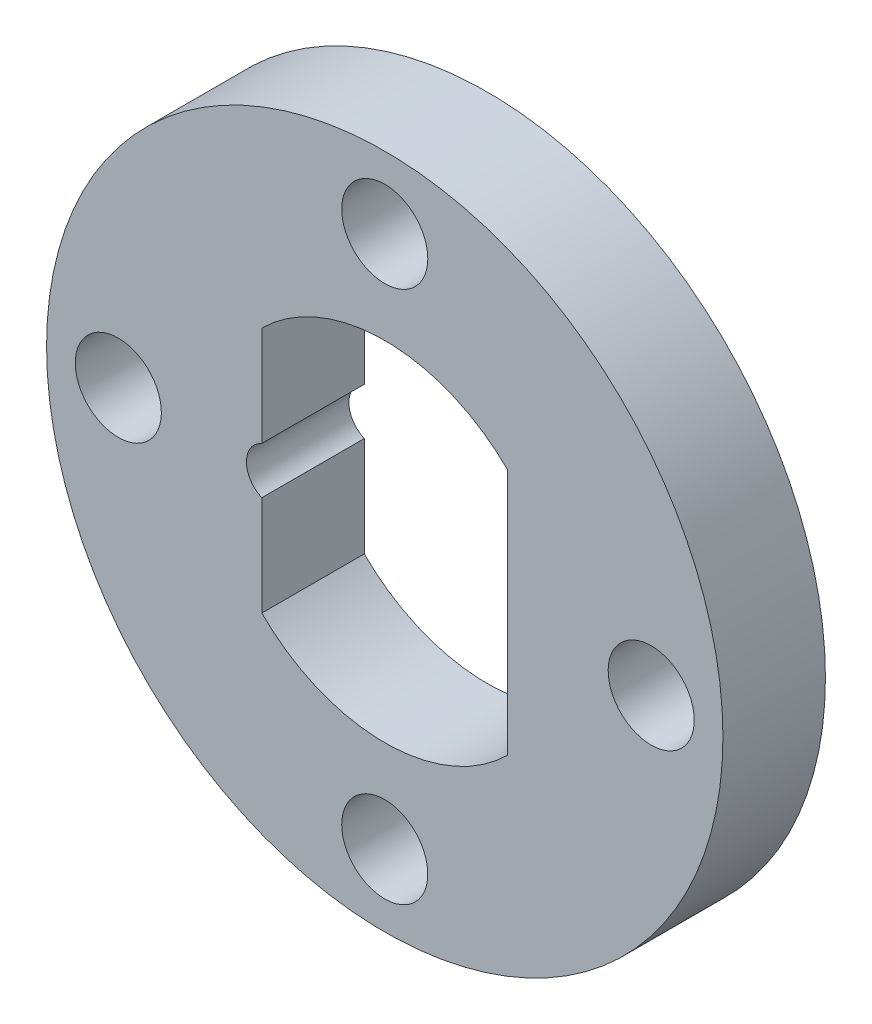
ISO-10303-21;
HEADER;
FILE_DESCRIPTION(('STEP AP214'),'2;1');
FILE_NAME('part.step','',(''),(''),'','','');
FILE_SCHEMA(('AUTOMOTIVE_DESIGN { 1 0 10303 214 1 1 1 1 }'));
ENDSEC;
DATA;
#1=APPLICATION_CONTEXT('core data for automotive mechanical design processes');
#2=APPLICATION_PROTOCOL_DEFINITION('international standard','automotive_design',2000,#1);
#3=PRODUCT_CONTEXT('',#1,'mechanical');
#4=PRODUCT('Part','Part','',(#3));
#5=PRODUCT_RELATED_PRODUCT_CATEGORY('part','',(#4));
#6=PRODUCT_DEFINITION_FORMATION('','',#4);
#7=PRODUCT_DEFINITION_CONTEXT('part definition',#1,'design');
#8=PRODUCT_DEFINITION('design','',#6,#7);
#9=PRODUCT_DEFINITION_SHAPE('','',#8);
#10=(LENGTH_UNIT() NAMED_UNIT(*) SI_UNIT(.MILLI.,.METRE.));
#11=(NAMED_UNIT(*) PLANE_ANGLE_UNIT() SI_UNIT($,.RADIAN.));
#12=(NAMED_UNIT(*) SI_UNIT($,.STERADIAN.) SOLID_ANGLE_UNIT());
#13=UNCERTAINTY_MEASURE_WITH_UNIT(LENGTH_MEASURE(1.E-05),#10,'distance_accuracy_value','');
#14=(GEOMETRIC_REPRESENTATION_CONTEXT(3) GLOBAL_UNCERTAINTY_ASSIGNED_CONTEXT((#13)) GLOBAL_UNIT_ASSIGNED_CONTEXT((#10,
#11,#12)) REPRESENTATION_CONTEXT('',''));
#15=CARTESIAN_POINT('',(0.,0.,0.));
#16=DIRECTION('',(0.,0.,1.));
#17=DIRECTION('',(1.,0.,0.));
#18=AXIS2_PLACEMENT_3D('',#15,#16,#17);
#19=CARTESIAN_POINT('',(-6.,6.02079728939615,5.));
#20=DIRECTION('',(1.,0.,0.));
#21=DIRECTION('',(0.,0.,-1.));
#22=AXIS2_PLACEMENT_3D('',#19,#20,#21);
#23=PLANE('',#22);
#24=DIRECTION('',(0.,0.,1.));
#25=VECTOR('',#24,1.);
#26=CARTESIAN_POINT('',(-6.,1.14564392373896,0.));
#27=LINE('',#26,#25);
#28=CARTESIAN_POINT('',(-6.,1.14564392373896,0.));
#29=VERTEX_POINT('',#28);
#30=CARTESIAN_POINT('',(-6.,1.14564392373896,5.));
#31=VERTEX_POINT('',#30);
#32=EDGE_CURVE('E11',#29,#31,#27,.T.);
#33=ORIENTED_EDGE('',*,*,#32,.F.);
#34=DIRECTION('',(0.,-1.,0.));
#35=VECTOR('',#34,1.);
#36=CARTESIAN_POINT('',(-6.,6.02079728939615,0.));
#37=LINE('',#36,#35);
#38=CARTESIAN_POINT('',(-6.,6.02079728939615,0.));
#39=VERTEX_POINT('',#38);
#40=EDGE_CURVE('E134',#39,#29,#37,.T.);
#41=ORIENTED_EDGE('',*,*,#40,.F.);
#42=DIRECTION('',(0.,0.,-1.));
#43=VECTOR('',#42,1.);
#44=CARTESIAN_POINT('',(-6.,6.02079728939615,5.));
#45=LINE('',#44,#43);
#46=CARTESIAN_POINT('',(-6.,6.02079728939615,5.));
#47=VERTEX_POINT('',#46);
#48=EDGE_CURVE('E104',#47,#39,#45,.T.);
#49=ORIENTED_EDGE('',*,*,#48,.F.);
#50=DIRECTION('',(0.,-1.,0.));
#51=VECTOR('',#50,1.);
#52=CARTESIAN_POINT('',(-6.,6.02079728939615,5.));
#53=LINE('',#52,#51);
#54=EDGE_CURVE('E98',#47,#31,#53,.T.);
#55=ORIENTED_EDGE('',*,*,#54,.T.);
#56=EDGE_LOOP('',(#33,#41,#49,#55));
#57=FACE_BOUND('',#56,.T.);
#58=ADVANCED_FACE('F36',(#57),#23,.T.);
#59=CARTESIAN_POINT('',(0.,0.,5.));
#60=DIRECTION('',(0.,0.,1.));
#61=DIRECTION('',(1.,0.,0.));
#62=AXIS2_PLACEMENT_3D('',#59,#60,#61);
#63=PLANE('',#62);
#64=CARTESIAN_POINT('',(-5.5,0.,5.));
#65=DIRECTION('',(0.,0.,1.));
#66=DIRECTION('',(1.,0.,0.));
#67=AXIS2_PLACEMENT_3D('',#64,#65,#66);
#68=CIRCLE('',#67,1.25);
#69=CARTESIAN_POINT('',(-6.,-1.14564392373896,5.));
#70=VERTEX_POINT('',#69);
#71=EDGE_CURVE('E50',#31,#70,#68,.T.);
#72=ORIENTED_EDGE('',*,*,#71,.F.);
#73=ORIENTED_EDGE('',*,*,#54,.F.);
#74=CARTESIAN_POINT('',(0.,0.,5.));
#75=DIRECTION('',(0.,0.,1.));
#76=DIRECTION('',(1.,0.,0.));
#77=AXIS2_PLACEMENT_3D('',#74,#75,#76);
#78=CIRCLE('',#77,8.5);
#79=CARTESIAN_POINT('',(6.,6.02079728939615,5.));
#80=VERTEX_POINT('',#79);
#81=EDGE_CURVE('E109',#80,#47,#78,.T.);
#82=ORIENTED_EDGE('',*,*,#81,.F.);
#83=DIRECTION('',(0.,1.,0.));
#84=VECTOR('',#83,1.);
#85=CARTESIAN_POINT('',(6.,6.02079728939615,5.));
#86=LINE('',#85,#84);
#87=CARTESIAN_POINT('',(6.,-6.02079728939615,5.));
#88=VERTEX_POINT('',#87);
#89=EDGE_CURVE('E107',#88,#80,#86,.T.);
#90=ORIENTED_EDGE('',*,*,#89,.F.);
#91=CARTESIAN_POINT('',(0.,0.,5.));
#92=DIRECTION('',(0.,0.,1.));
#93=DIRECTION('',(1.,0.,0.));
#94=AXIS2_PLACEMENT_3D('',#91,#92,#93);
#95=CIRCLE('',#94,8.5);
#96=CARTESIAN_POINT('',(-6.,-6.02079728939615,5.));
#97=VERTEX_POINT('',#96);
#98=EDGE_CURVE('E105',#97,#88,#95,.T.);
#99=ORIENTED_EDGE('',*,*,#98,.F.);
#100=EDGE_CURVE('E100',#70,#97,#53,.T.);
#101=ORIENTED_EDGE('',*,*,#100,.F.);
#102=EDGE_LOOP('',(#72,#73,#82,#90,#99,#101));
#103=FACE_BOUND('',#102,.T.);
#104=CARTESIAN_POINT('',(-13.,1.36167851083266E-13,5.));
#105=DIRECTION('',(0.,0.,1.));
#106=DIRECTION('',(0.,1.,0.));
#107=AXIS2_PLACEMENT_3D('',#104,#105,#106);
#108=CIRCLE('',#107,2.1);
#109=CARTESIAN_POINT('',(-13.,2.10000000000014,5.));
#110=VERTEX_POINT('',#109);
#111=EDGE_CURVE('E135',#110,#110,#108,.T.);
#112=ORIENTED_EDGE('',*,*,#111,.F.);
#113=EDGE_LOOP('',(#112));
#114=FACE_BOUND('',#113,.T.);
#115=CARTESIAN_POINT('',(0.,-13.,5.));
#116=DIRECTION('',(0.,0.,1.));
#117=DIRECTION('',(-1.,0.,0.));
#118=AXIS2_PLACEMENT_3D('',#115,#116,#117);
#119=CIRCLE('',#118,2.1);
#120=CARTESIAN_POINT('',(-2.10000000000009,-13.,5.));
#121=VERTEX_POINT('',#120);
#122=EDGE_CURVE('E205',#121,#121,#119,.T.);
#123=ORIENTED_EDGE('',*,*,#122,.F.);
#124=EDGE_LOOP('',(#123));
#125=FACE_BOUND('',#124,.T.);
#126=CARTESIAN_POINT('',(13.,0.,5.));
#127=DIRECTION('',(0.,0.,1.));
#128=DIRECTION('',(0.,-1.,0.));
#129=AXIS2_PLACEMENT_3D('',#126,#127,#128);
#130=CIRCLE('',#129,2.1);
#131=CARTESIAN_POINT('',(13.,-2.10000000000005,5.));
#132=VERTEX_POINT('',#131);
#133=EDGE_CURVE('E201',#132,#132,#130,.T.);
#134=ORIENTED_EDGE('',*,*,#133,.F.);
#135=EDGE_LOOP('',(#134));
#136=FACE_BOUND('',#135,.T.);
#137=CARTESIAN_POINT('',(0.,13.,5.));
#138=DIRECTION('',(0.,0.,1.));
#139=DIRECTION('',(1.,0.,0.));
#140=AXIS2_PLACEMENT_3D('',#137,#138,#139);
#141=CIRCLE('',#140,2.1);
#142=CARTESIAN_POINT('',(2.1,13.,5.));
#143=VERTEX_POINT('',#142);
#144=EDGE_CURVE('E196',#143,#143,#141,.T.);
#145=ORIENTED_EDGE('',*,*,#144,.F.);
#146=EDGE_LOOP('',(#145));
#147=FACE_BOUND('',#146,.T.);
#148=CARTESIAN_POINT('',(0.,0.,5.));
#149=DIRECTION('',(0.,0.,1.));
#150=DIRECTION('',(1.,0.,0.));
#151=AXIS2_PLACEMENT_3D('',#148,#149,#150);
#152=CIRCLE('',#151,16.5);
#153=CARTESIAN_POINT('',(16.5,0.,5.));
#154=VERTEX_POINT('',#153);
#155=EDGE_CURVE('E125',#154,#154,#152,.T.);
#156=ORIENTED_EDGE('',*,*,#155,.T.);
#157=EDGE_LOOP('',(#156));
#158=FACE_BOUND('',#157,.T.);
#159=ADVANCED_FACE('F95',(#103,#114,#125,#136,#147,#158),#63,.T.);
#160=CARTESIAN_POINT('',(0.,0.,0.));
#161=DIRECTION('',(0.,0.,1.));
#162=DIRECTION('',(1.,0.,0.));
#163=AXIS2_PLACEMENT_3D('',#160,#161,#162);
#164=PLANE('',#163);
#165=CARTESIAN_POINT('',(-13.,1.36167851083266E-13,0.));
#166=DIRECTION('',(0.,0.,1.));
#167=DIRECTION('',(0.,1.,0.));
#168=AXIS2_PLACEMENT_3D('',#165,#166,#167);
#169=CIRCLE('',#168,2.1);
#170=CARTESIAN_POINT('',(-13.,2.10000000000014,0.));
#171=VERTEX_POINT('',#170);
#172=EDGE_CURVE('E181',#171,#171,#169,.T.);
#173=ORIENTED_EDGE('',*,*,#172,.T.);
#174=EDGE_LOOP('',(#173));
#175=FACE_BOUND('',#174,.T.);
#176=CARTESIAN_POINT('',(0.,-13.,0.));
#177=DIRECTION('',(0.,0.,1.));
#178=DIRECTION('',(-1.,0.,0.));
#179=AXIS2_PLACEMENT_3D('',#176,#177,#178);
#180=CIRCLE('',#179,2.1);
#181=CARTESIAN_POINT('',(-2.10000000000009,-13.,0.));
#182=VERTEX_POINT('',#181);
#183=EDGE_CURVE('E185',#182,#182,#180,.T.);
#184=ORIENTED_EDGE('',*,*,#183,.T.);
#185=EDGE_LOOP('',(#184));
#186=FACE_BOUND('',#185,.T.);
#187=CARTESIAN_POINT('',(13.,0.,0.));
#188=DIRECTION('',(0.,0.,1.));
#189=DIRECTION('',(0.,-1.,0.));
#190=AXIS2_PLACEMENT_3D('',#187,#188,#189);
#191=CIRCLE('',#190,2.1);
#192=CARTESIAN_POINT('',(13.,-2.10000000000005,0.));
#193=VERTEX_POINT('',#192);
#194=EDGE_CURVE('E189',#193,#193,#191,.T.);
#195=ORIENTED_EDGE('',*,*,#194,.T.);
#196=EDGE_LOOP('',(#195));
#197=FACE_BOUND('',#196,.T.);
#198=CARTESIAN_POINT('',(0.,13.,0.));
#199=DIRECTION('',(0.,0.,1.));
#200=DIRECTION('',(1.,0.,0.));
#201=AXIS2_PLACEMENT_3D('',#198,#199,#200);
#202=CIRCLE('',#201,2.1);
#203=CARTESIAN_POINT('',(2.1,13.,0.));
#204=VERTEX_POINT('',#203);
#205=EDGE_CURVE('E143',#204,#204,#202,.T.);
#206=ORIENTED_EDGE('',*,*,#205,.T.);
#207=EDGE_LOOP('',(#206));
#208=FACE_BOUND('',#207,.T.);
#209=CARTESIAN_POINT('',(0.,0.,0.));
#210=DIRECTION('',(0.,0.,1.));
#211=DIRECTION('',(1.,0.,0.));
#212=AXIS2_PLACEMENT_3D('',#209,#210,#211);
#213=CIRCLE('',#212,16.5);
#214=CARTESIAN_POINT('',(16.5,0.,0.));
#215=VERTEX_POINT('',#214);
#216=EDGE_CURVE('E122',#215,#215,#213,.T.);
#217=ORIENTED_EDGE('',*,*,#216,.F.);
#218=EDGE_LOOP('',(#217));
#219=FACE_BOUND('',#218,.T.);
#220=ORIENTED_EDGE('',*,*,#40,.T.);
#221=CARTESIAN_POINT('',(-5.5,0.,0.));
#222=DIRECTION('',(0.,0.,1.));
#223=DIRECTION('',(1.,0.,0.));
#224=AXIS2_PLACEMENT_3D('',#221,#222,#223);
#225=CIRCLE('',#224,1.25);
#226=CARTESIAN_POINT('',(-6.,-1.14564392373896,0.));
#227=VERTEX_POINT('',#226);
#228=EDGE_CURVE('E88',#29,#227,#225,.T.);
#229=ORIENTED_EDGE('',*,*,#228,.T.);
#230=CARTESIAN_POINT('',(-6.,-6.02079728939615,0.));
#231=VERTEX_POINT('',#230);
#232=EDGE_CURVE('E132',#227,#231,#37,.T.);
#233=ORIENTED_EDGE('',*,*,#232,.T.);
#234=CARTESIAN_POINT('',(0.,0.,0.));
#235=DIRECTION('',(0.,0.,1.));
#236=DIRECTION('',(1.,0.,0.));
#237=AXIS2_PLACEMENT_3D('',#234,#235,#236);
#238=CIRCLE('',#237,8.5);
#239=CARTESIAN_POINT('',(6.,-6.02079728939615,0.));
#240=VERTEX_POINT('',#239);
#241=EDGE_CURVE('E142',#231,#240,#238,.T.);
#242=ORIENTED_EDGE('',*,*,#241,.T.);
#243=DIRECTION('',(0.,1.,0.));
#244=VECTOR('',#243,1.);
#245=CARTESIAN_POINT('',(6.,6.02079728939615,0.));
#246=LINE('',#245,#244);
#247=CARTESIAN_POINT('',(6.,6.02079728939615,0.));
#248=VERTEX_POINT('',#247);
#249=EDGE_CURVE('E147',#240,#248,#246,.T.);
#250=ORIENTED_EDGE('',*,*,#249,.T.);
#251=CARTESIAN_POINT('',(0.,0.,0.));
#252=DIRECTION('',(0.,0.,1.));
#253=DIRECTION('',(1.,0.,0.));
#254=AXIS2_PLACEMENT_3D('',#251,#252,#253);
#255=CIRCLE('',#254,8.5);
#256=EDGE_CURVE('E140',#248,#39,#255,.T.);
#257=ORIENTED_EDGE('',*,*,#256,.T.);
#258=EDGE_LOOP('',(#220,#229,#233,#242,#250,#257));
#259=FACE_BOUND('',#258,.T.);
#260=ADVANCED_FACE('F130',(#175,#186,#197,#208,#219,#259),#164,.F.);
#261=CARTESIAN_POINT('',(0.,0.,5.));
#262=DIRECTION('',(0.,0.,-1.));
#263=DIRECTION('',(-1.,0.,0.));
#264=AXIS2_PLACEMENT_3D('',#261,#262,#263);
#265=CYLINDRICAL_SURFACE('',#264,16.5);
#266=ORIENTED_EDGE('',*,*,#155,.F.);
#267=EDGE_LOOP('',(#266));
#268=FACE_BOUND('',#267,.T.);
#269=ORIENTED_EDGE('',*,*,#216,.T.);
#270=EDGE_LOOP('',(#269));
#271=FACE_BOUND('',#270,.T.);
#272=ADVANCED_FACE('F38',(#268,#271),#265,.T.);
#273=CARTESIAN_POINT('',(0.,0.,5.));
#274=DIRECTION('',(0.,0.,-1.));
#275=DIRECTION('',(-1.,0.,0.));
#276=AXIS2_PLACEMENT_3D('',#273,#274,#275);
#277=CYLINDRICAL_SURFACE('',#276,8.5);
#278=ORIENTED_EDGE('',*,*,#256,.F.);
#279=DIRECTION('',(0.,0.,-1.));
#280=VECTOR('',#279,1.);
#281=CARTESIAN_POINT('',(6.,6.02079728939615,5.));
#282=LINE('',#281,#280);
#283=EDGE_CURVE('E114',#80,#248,#282,.T.);
#284=ORIENTED_EDGE('',*,*,#283,.F.);
#285=ORIENTED_EDGE('',*,*,#81,.T.);
#286=ORIENTED_EDGE('',*,*,#48,.T.);
#287=EDGE_LOOP('',(#278,#284,#285,#286));
#288=FACE_BOUND('',#287,.T.);
#289=ADVANCED_FACE('F151',(#288),#277,.F.);
#290=DIRECTION('',(0.,0.,1.));
#291=VECTOR('',#290,1.);
#292=CARTESIAN_POINT('',(-6.,-1.14564392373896,0.));
#293=LINE('',#292,#291);
#294=EDGE_CURVE('E44',#70,#227,#293,.F.);
#295=ORIENTED_EDGE('',*,*,#294,.F.);
#296=ORIENTED_EDGE('',*,*,#100,.T.);
#297=DIRECTION('',(0.,0.,-1.));
#298=VECTOR('',#297,1.);
#299=CARTESIAN_POINT('',(-6.,-6.02079728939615,5.));
#300=LINE('',#299,#298);
#301=EDGE_CURVE('E118',#97,#231,#300,.T.);
#302=ORIENTED_EDGE('',*,*,#301,.T.);
#303=ORIENTED_EDGE('',*,*,#232,.F.);
#304=EDGE_LOOP('',(#295,#296,#302,#303));
#305=FACE_BOUND('',#304,.T.);
#306=ADVANCED_FACE('F137',(#305),#23,.T.);
#307=CARTESIAN_POINT('',(0.,0.,5.));
#308=DIRECTION('',(0.,0.,-1.));
#309=DIRECTION('',(-1.,0.,0.));
#310=AXIS2_PLACEMENT_3D('',#307,#308,#309);
#311=CYLINDRICAL_SURFACE('',#310,8.5);
#312=ORIENTED_EDGE('',*,*,#241,.F.);
#313=ORIENTED_EDGE('',*,*,#301,.F.);
#314=ORIENTED_EDGE('',*,*,#98,.T.);
#315=DIRECTION('',(0.,0.,-1.));
#316=VECTOR('',#315,1.);
#317=CARTESIAN_POINT('',(6.,-6.02079728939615,5.));
#318=LINE('',#317,#316);
#319=EDGE_CURVE('E58',#88,#240,#318,.T.);
#320=ORIENTED_EDGE('',*,*,#319,.T.);
#321=EDGE_LOOP('',(#312,#313,#314,#320));
#322=FACE_BOUND('',#321,.T.);
#323=ADVANCED_FACE('F155',(#322),#311,.F.);
#324=CARTESIAN_POINT('',(6.,6.02079728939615,5.));
#325=DIRECTION('',(-1.,0.,0.));
#326=DIRECTION('',(0.,0.,1.));
#327=AXIS2_PLACEMENT_3D('',#324,#325,#326);
#328=PLANE('',#327);
#329=ORIENTED_EDGE('',*,*,#249,.F.);
#330=ORIENTED_EDGE('',*,*,#319,.F.);
#331=ORIENTED_EDGE('',*,*,#89,.T.);
#332=ORIENTED_EDGE('',*,*,#283,.T.);
#333=EDGE_LOOP('',(#329,#330,#331,#332));
#334=FACE_BOUND('',#333,.T.);
#335=ADVANCED_FACE('F153',(#334),#328,.T.);
#336=CARTESIAN_POINT('',(0.,13.,0.));
#337=DIRECTION('',(0.,0.,1.));
#338=DIRECTION('',(1.,0.,0.));
#339=AXIS2_PLACEMENT_3D('',#336,#337,#338);
#340=CYLINDRICAL_SURFACE('',#339,2.1);
#341=ORIENTED_EDGE('',*,*,#205,.F.);
#342=EDGE_LOOP('',(#341));
#343=FACE_BOUND('',#342,.T.);
#344=ORIENTED_EDGE('',*,*,#144,.T.);
#345=EDGE_LOOP('',(#344));
#346=FACE_BOUND('',#345,.T.);
#347=ADVANCED_FACE('F162',(#343,#346),#340,.F.);
#348=CARTESIAN_POINT('',(13.,0.,0.));
#349=DIRECTION('',(0.,0.,1.));
#350=DIRECTION('',(1.,0.,0.));
#351=AXIS2_PLACEMENT_3D('',#348,#349,#350);
#352=CYLINDRICAL_SURFACE('',#351,2.1);
#353=ORIENTED_EDGE('',*,*,#194,.F.);
#354=EDGE_LOOP('',(#353));
#355=FACE_BOUND('',#354,.T.);
#356=ORIENTED_EDGE('',*,*,#133,.T.);
#357=EDGE_LOOP('',(#356));
#358=FACE_BOUND('',#357,.T.);
#359=ADVANCED_FACE('F223',(#355,#358),#352,.F.);
#360=CARTESIAN_POINT('',(0.,-13.,0.));
#361=DIRECTION('',(0.,0.,1.));
#362=DIRECTION('',(1.,0.,0.));
#363=AXIS2_PLACEMENT_3D('',#360,#361,#362);
#364=CYLINDRICAL_SURFACE('',#363,2.1);
#365=ORIENTED_EDGE('',*,*,#183,.F.);
#366=EDGE_LOOP('',(#365));
#367=FACE_BOUND('',#366,.T.);
#368=ORIENTED_EDGE('',*,*,#122,.T.);
#369=EDGE_LOOP('',(#368));
#370=FACE_BOUND('',#369,.T.);
#371=ADVANCED_FACE('F228',(#367,#370),#364,.F.);
#372=CARTESIAN_POINT('',(-13.,1.36167851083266E-13,0.));
#373=DIRECTION('',(0.,0.,1.));
#374=DIRECTION('',(1.,0.,0.));
#375=AXIS2_PLACEMENT_3D('',#372,#373,#374);
#376=CYLINDRICAL_SURFACE('',#375,2.1);
#377=ORIENTED_EDGE('',*,*,#172,.F.);
#378=EDGE_LOOP('',(#377));
#379=FACE_BOUND('',#378,.T.);
#380=ORIENTED_EDGE('',*,*,#111,.T.);
#381=EDGE_LOOP('',(#380));
#382=FACE_BOUND('',#381,.T.);
#383=ADVANCED_FACE('F212',(#379,#382),#376,.F.);
#384=CARTESIAN_POINT('',(-5.5,0.,0.));
#385=DIRECTION('',(0.,0.,1.));
#386=DIRECTION('',(1.,0.,0.));
#387=AXIS2_PLACEMENT_3D('',#384,#385,#386);
#388=CYLINDRICAL_SURFACE('',#387,1.25);
#389=ORIENTED_EDGE('',*,*,#32,.T.);
#390=ORIENTED_EDGE('',*,*,#71,.T.);
#391=ORIENTED_EDGE('',*,*,#294,.T.);
#392=ORIENTED_EDGE('',*,*,#228,.F.);
#393=EDGE_LOOP('',(#389,#390,#391,#392));
#394=FACE_BOUND('',#393,.T.);
#395=ADVANCED_FACE('F86',(#394),#388,.F.);
#396=CLOSED_SHELL('',(#58,#159,#260,#272,#289,#306,#323,#335,#347,#359,#371,#383,#395));
#397=MANIFOLD_SOLID_BREP('B2',#396);
#398=ADVANCED_BREP_SHAPE_REPRESENTATION('',(#18,#397),#14);
#399=SHAPE_DEFINITION_REPRESENTATION(#9,#398);
ENDSEC;
END-ISO-10303-21;
